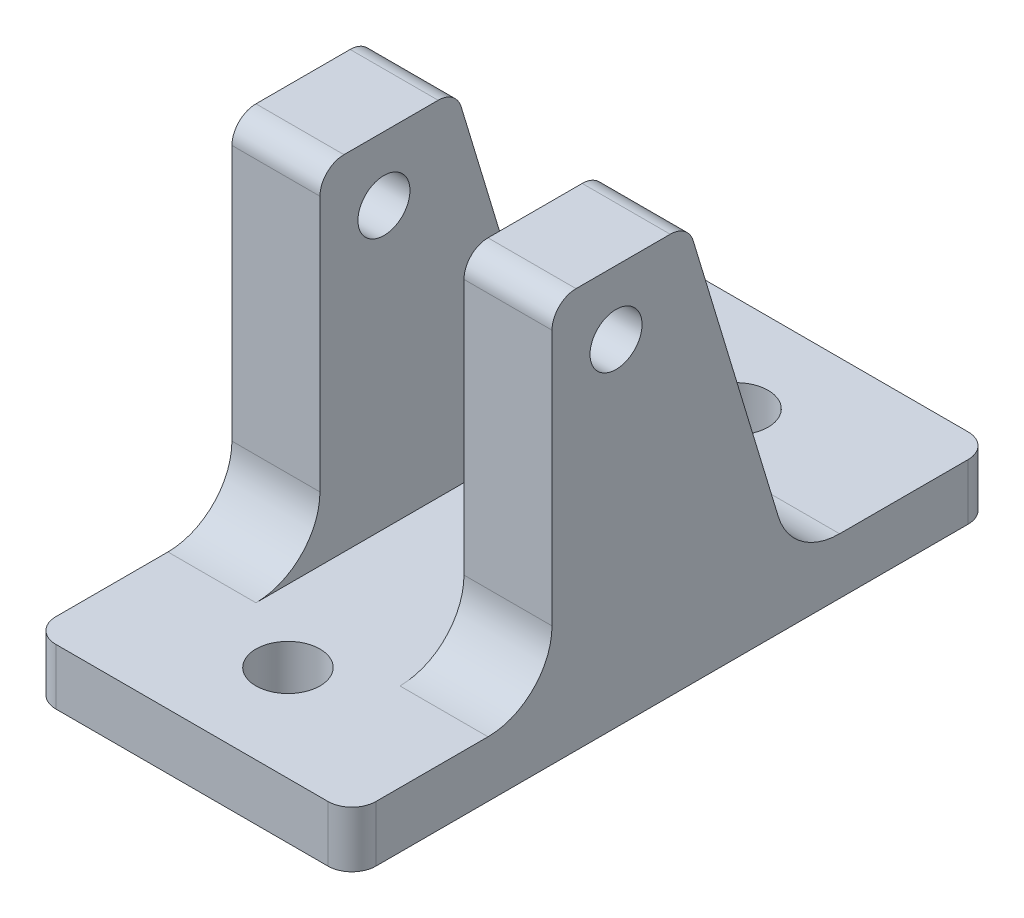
from build123d import *

# Parameters (mm, degrees)
SKETCH1_W             = 11
SKETCH1_H             = 43
BOSS_EXTRUDE1_DEPTH   = 25
BOSS_EXTRUDE1_2_DEPTH = 25
SKETCH2_W             = 40
SKETCH2_H             = 80
SKETCH2_R             = 4
BOSS_EXTRUDE2_DEPTH   = 7
SKETCH3_R             = 3.25
CUT_EXTRUDE1_DEPTH    = 517.407635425
SKETCH7_W             = 11
SKETCH7_H             = 43
BOSS_EXTRUDE4_DEPTH   = 30
CUT_EXTRUDE3_DEPTH    = 517.407635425
FILLET1_R             = 8
FILLET2_R             = 3


with BuildPart() as part:
    # Sketch1 → Boss-Extrude1 (new body)
    with BuildSketch(Plane.XY):
        with Locations((8, -483.922526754)):
            Rectangle(SKETCH1_W, SKETCH1_H)
    extrude(amount=BOSS_EXTRUDE1_DEPTH)

    # Sketch2 → Boss-Extrude2 (add)
    with BuildSketch(Plane(origin=(0, -505.422526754, 0), x_dir=(-1, 0, 0), z_dir=(0, -1, 0))):
        with Locations((6.5, -10)):
            Rectangle(SKETCH2_W, SKETCH2_H)
        with Locations(Location((6.5, -38, 0), (0, 0, 180))):
            Circle(SKETCH2_R, mode=Mode.SUBTRACT)
        with Locations(Location((6.5, 18, 0), (0, 0, 180))):
            Circle(SKETCH2_R, mode=Mode.SUBTRACT)
    extrude(amount=BOSS_EXTRUDE2_DEPTH)


with BuildPart() as body_2:
    # Sketch1 → Boss-Extrude1 2 (new body)
    with BuildSketch(Plane.XY):
        with Locations((-21, -483.922526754)):
            Rectangle(SKETCH1_W, SKETCH1_H)
    extrude(amount=BOSS_EXTRUDE1_2_DEPTH)


with BuildPart() as cut_extrude1_tool:
    # Sketch3 → Cut-Extrude1 (new, through all)
    with BuildSketch(Plane(origin=(13.5, 0, 0), x_dir=(0, 0, -1), z_dir=(1, 0, 0))):
        with Locations(Location((-17, -470.422526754, 0), (0, 0, 90))):
            Circle(SKETCH3_R)
    extrude(amount=-CUT_EXTRUDE1_DEPTH)


with BuildPart() as part_1:
    add(part.part)

    # Cut-Extrude1: cut by cut_extrude1_tool
    add(cut_extrude1_tool.part, mode=Mode.SUBTRACT)



with BuildPart() as body_2_1:
    add(body_2.part)

    # Cut-Extrude1: cut by cut_extrude1_tool
    add(cut_extrude1_tool.part, mode=Mode.SUBTRACT)


with BuildPart() as part_2:
    add(part_1.part)

    add(body_2_1.part)  # Boss-Extrude4 merges body 2
    # Sketch7 → Boss-Extrude4 (add)
    with BuildSketch(Plane(origin=(0, 0, 0), x_dir=(-1, 0, 0), z_dir=(0, 0, -1))):
        with Locations((-8, -483.922526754)):
            Rectangle(SKETCH7_W, SKETCH7_H)
        with Locations((21, -483.922526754)):
            Rectangle(SKETCH7_W, SKETCH7_H)
    extrude(amount=BOSS_EXTRUDE4_DEPTH)

    # Sketch8 → Cut-Extrude3 (cut, through all)
    with BuildSketch(Plane(origin=(13.5, 0, 0), x_dir=(0, 0, -1), z_dir=(1, 0, 0))):
        Polygon((30, -505.422526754), (30, -462.422526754), (-8, -462.422526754), (5, -505.422526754), align=None)
    extrude(amount=-CUT_EXTRUDE3_DEPTH, mode=Mode.SUBTRACT)

    # Fillet1
    fillet1_edges = [part_2.edges().sort_by_distance(p)[0] for p in [
        (8, -505.422526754, 25),
        (-21, -505.422526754, 25),
        (-21, -505.422526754, -5),
        (8, -505.422526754, -5),
    ]]
    fillet(fillet1_edges, radius=FILLET1_R)

    # Fillet2
    fillet2_edges = [part_2.edges().sort_by_distance(p)[0] for p in [
        (-26.5, -508.922526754, 50),
        (-26.5, -508.922526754, -30),
        (13.5, -508.922526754, -30),
        (13.5, -508.922526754, 50),
        (8, -462.422526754, 25),
        (-21, -462.422526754, 25),
        (-21, -462.422526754, 8),
        (8, -462.422526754, 8),
    ]]
    fillet(fillet2_edges, radius=FILLET2_R)


solid = part_2.part
